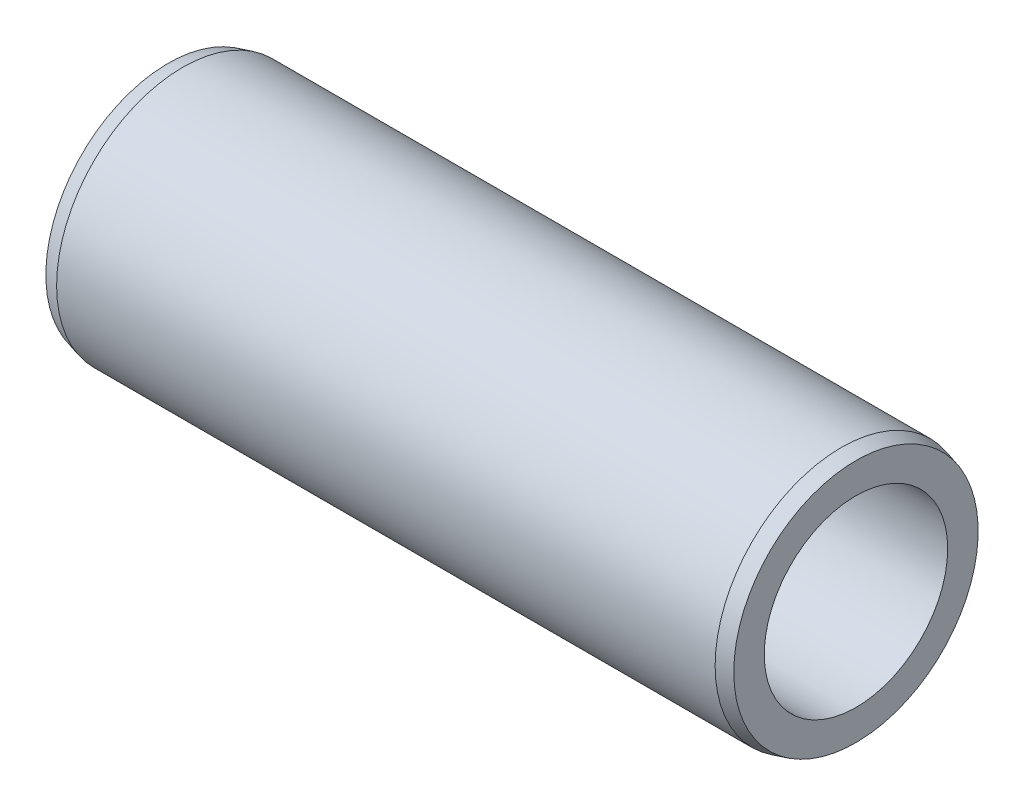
ISO-10303-21;
HEADER;
FILE_DESCRIPTION(('STEP AP214'),'2;1');
FILE_NAME('part.step','',(''),(''),'','','');
FILE_SCHEMA(('AUTOMOTIVE_DESIGN { 1 0 10303 214 1 1 1 1 }'));
ENDSEC;
DATA;
#1=APPLICATION_CONTEXT('core data for automotive mechanical design processes');
#2=APPLICATION_PROTOCOL_DEFINITION('international standard','automotive_design',2000,#1);
#3=PRODUCT_CONTEXT('',#1,'mechanical');
#4=PRODUCT('Part','Part','',(#3));
#5=PRODUCT_RELATED_PRODUCT_CATEGORY('part','',(#4));
#6=PRODUCT_DEFINITION_FORMATION('','',#4);
#7=PRODUCT_DEFINITION_CONTEXT('part definition',#1,'design');
#8=PRODUCT_DEFINITION('design','',#6,#7);
#9=PRODUCT_DEFINITION_SHAPE('','',#8);
#10=(LENGTH_UNIT() NAMED_UNIT(*) SI_UNIT(.MILLI.,.METRE.));
#11=(NAMED_UNIT(*) PLANE_ANGLE_UNIT() SI_UNIT($,.RADIAN.));
#12=(NAMED_UNIT(*) SI_UNIT($,.STERADIAN.) SOLID_ANGLE_UNIT());
#13=UNCERTAINTY_MEASURE_WITH_UNIT(LENGTH_MEASURE(1.E-05),#10,'distance_accuracy_value','');
#14=(GEOMETRIC_REPRESENTATION_CONTEXT(3) GLOBAL_UNCERTAINTY_ASSIGNED_CONTEXT((#13)) GLOBAL_UNIT_ASSIGNED_CONTEXT((#10,
#11,#12)) REPRESENTATION_CONTEXT('',''));
#15=CARTESIAN_POINT('',(0.,0.,0.));
#16=DIRECTION('',(0.,0.,1.));
#17=DIRECTION('',(1.,0.,0.));
#18=AXIS2_PLACEMENT_3D('',#15,#16,#17);
#19=CARTESIAN_POINT('',(-16.51660159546,0.,0.));
#20=DIRECTION('',(1.,0.,0.));
#21=DIRECTION('',(0.,0.,-1.));
#22=AXIS2_PLACEMENT_3D('',#19,#20,#21);
#23=CYLINDRICAL_SURFACE('',#22,4.);
#24=CARTESIAN_POINT('',(15.,0.,0.));
#25=DIRECTION('',(1.,0.,0.));
#26=DIRECTION('',(0.,0.,-1.));
#27=AXIS2_PLACEMENT_3D('',#24,#25,#26);
#28=CIRCLE('',#27,4.);
#29=CARTESIAN_POINT('',(15.,0.,-4.));
#30=VERTEX_POINT('',#29);
#31=EDGE_CURVE('E18',#30,#30,#28,.F.);
#32=ORIENTED_EDGE('',*,*,#31,.F.);
#33=EDGE_LOOP('',(#32));
#34=FACE_BOUND('',#33,.T.);
#35=CARTESIAN_POINT('',(-15.,0.,0.));
#36=DIRECTION('',(1.,0.,0.));
#37=DIRECTION('',(0.,0.,-1.));
#38=AXIS2_PLACEMENT_3D('',#35,#36,#37);
#39=CIRCLE('',#38,4.);
#40=CARTESIAN_POINT('',(-15.,0.,-4.));
#41=VERTEX_POINT('',#40);
#42=EDGE_CURVE('E40',#41,#41,#39,.F.);
#43=ORIENTED_EDGE('',*,*,#42,.T.);
#44=EDGE_LOOP('',(#43));
#45=FACE_BOUND('',#44,.T.);
#46=ADVANCED_FACE('F15',(#34,#45),#23,.F.);
#47=CARTESIAN_POINT('',(15.,0.,0.));
#48=DIRECTION('',(1.,0.,0.));
#49=DIRECTION('',(0.,0.,-1.));
#50=AXIS2_PLACEMENT_3D('',#47,#48,#49);
#51=PLANE('',#50);
#52=ORIENTED_EDGE('',*,*,#31,.T.);
#53=EDGE_LOOP('',(#52));
#54=FACE_BOUND('',#53,.T.);
#55=CARTESIAN_POINT('',(14.9999999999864,0.,0.));
#56=DIRECTION('',(-1.,0.,0.));
#57=DIRECTION('',(0.,0.,1.));
#58=AXIS2_PLACEMENT_3D('',#55,#56,#57);
#59=CIRCLE('',#58,5.32812763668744);
#60=CARTESIAN_POINT('',(14.9999999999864,0.,5.32812763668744));
#61=VERTEX_POINT('',#60);
#62=EDGE_CURVE('E37',#61,#61,#59,.T.);
#63=ORIENTED_EDGE('',*,*,#62,.F.);
#64=EDGE_LOOP('',(#63));
#65=FACE_BOUND('',#64,.T.);
#66=ADVANCED_FACE('F48',(#54,#65),#51,.T.);
#67=CARTESIAN_POINT('',(-15.,0.,0.));
#68=DIRECTION('',(1.,0.,0.));
#69=DIRECTION('',(0.,0.,-1.));
#70=AXIS2_PLACEMENT_3D('',#67,#68,#69);
#71=PLANE('',#70);
#72=ORIENTED_EDGE('',*,*,#42,.F.);
#73=EDGE_LOOP('',(#72));
#74=FACE_BOUND('',#73,.T.);
#75=CARTESIAN_POINT('',(-14.9999999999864,0.,0.));
#76=DIRECTION('',(1.,0.,0.));
#77=DIRECTION('',(0.,0.,-1.));
#78=AXIS2_PLACEMENT_3D('',#75,#76,#77);
#79=CIRCLE('',#78,5.32812763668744);
#80=CARTESIAN_POINT('',(-14.9999999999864,0.,-5.32812763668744));
#81=VERTEX_POINT('',#80);
#82=EDGE_CURVE('E32',#81,#81,#79,.T.);
#83=ORIENTED_EDGE('',*,*,#82,.F.);
#84=EDGE_LOOP('',(#83));
#85=FACE_BOUND('',#84,.T.);
#86=ADVANCED_FACE('F56',(#74,#85),#71,.F.);
#87=CARTESIAN_POINT('',(14.3585636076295,0.,0.));
#88=DIRECTION('',(-1.,0.,0.));
#89=DIRECTION('',(0.,0.,1.));
#90=AXIS2_PLACEMENT_3D('',#87,#88,#89);
#91=CONICAL_SURFACE('',#90,5.50000000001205,0.261799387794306);
#92=CARTESIAN_POINT('',(14.35856360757,0.,0.));
#93=DIRECTION('',(1.,0.,0.));
#94=DIRECTION('',(0.,0.,-1.));
#95=AXIS2_PLACEMENT_3D('',#92,#93,#94);
#96=CIRCLE('',#95,5.5);
#97=CARTESIAN_POINT('',(14.35856360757,0.,-5.5));
#98=VERTEX_POINT('',#97);
#99=EDGE_CURVE('E23',#98,#98,#96,.F.);
#100=ORIENTED_EDGE('',*,*,#99,.F.);
#101=EDGE_LOOP('',(#100));
#102=FACE_BOUND('',#101,.T.);
#103=ORIENTED_EDGE('',*,*,#62,.T.);
#104=EDGE_LOOP('',(#103));
#105=FACE_BOUND('',#104,.T.);
#106=ADVANCED_FACE('F62',(#102,#105),#91,.T.);
#107=CARTESIAN_POINT('',(-14.3585636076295,0.,0.));
#108=DIRECTION('',(1.,0.,0.));
#109=DIRECTION('',(0.,0.,-1.));
#110=AXIS2_PLACEMENT_3D('',#107,#108,#109);
#111=CONICAL_SURFACE('',#110,5.50000000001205,0.261799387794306);
#112=ORIENTED_EDGE('',*,*,#82,.T.);
#113=EDGE_LOOP('',(#112));
#114=FACE_BOUND('',#113,.T.);
#115=CARTESIAN_POINT('',(-14.35856360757,0.,0.));
#116=DIRECTION('',(1.,0.,0.));
#117=DIRECTION('',(0.,0.,-1.));
#118=AXIS2_PLACEMENT_3D('',#115,#116,#117);
#119=CIRCLE('',#118,5.5);
#120=CARTESIAN_POINT('',(-14.35856360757,0.,-5.5));
#121=VERTEX_POINT('',#120);
#122=EDGE_CURVE('E10',#121,#121,#119,.T.);
#123=ORIENTED_EDGE('',*,*,#122,.F.);
#124=EDGE_LOOP('',(#123));
#125=FACE_BOUND('',#124,.T.);
#126=ADVANCED_FACE('F58',(#114,#125),#111,.T.);
#127=CARTESIAN_POINT('',(-16.51660159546,0.,0.));
#128=DIRECTION('',(1.,0.,0.));
#129=DIRECTION('',(0.,0.,-1.));
#130=AXIS2_PLACEMENT_3D('',#127,#128,#129);
#131=CYLINDRICAL_SURFACE('',#130,5.5);
#132=ORIENTED_EDGE('',*,*,#122,.T.);
#133=EDGE_LOOP('',(#132));
#134=FACE_BOUND('',#133,.T.);
#135=ORIENTED_EDGE('',*,*,#99,.T.);
#136=EDGE_LOOP('',(#135));
#137=FACE_BOUND('',#136,.T.);
#138=ADVANCED_FACE('F57',(#134,#137),#131,.T.);
#139=CLOSED_SHELL('',(#46,#66,#86,#106,#126,#138));
#140=MANIFOLD_SOLID_BREP('B1',#139);
#141=ADVANCED_BREP_SHAPE_REPRESENTATION('',(#18,#140),#14);
#142=SHAPE_DEFINITION_REPRESENTATION(#9,#141);
ENDSEC;
END-ISO-10303-21;
